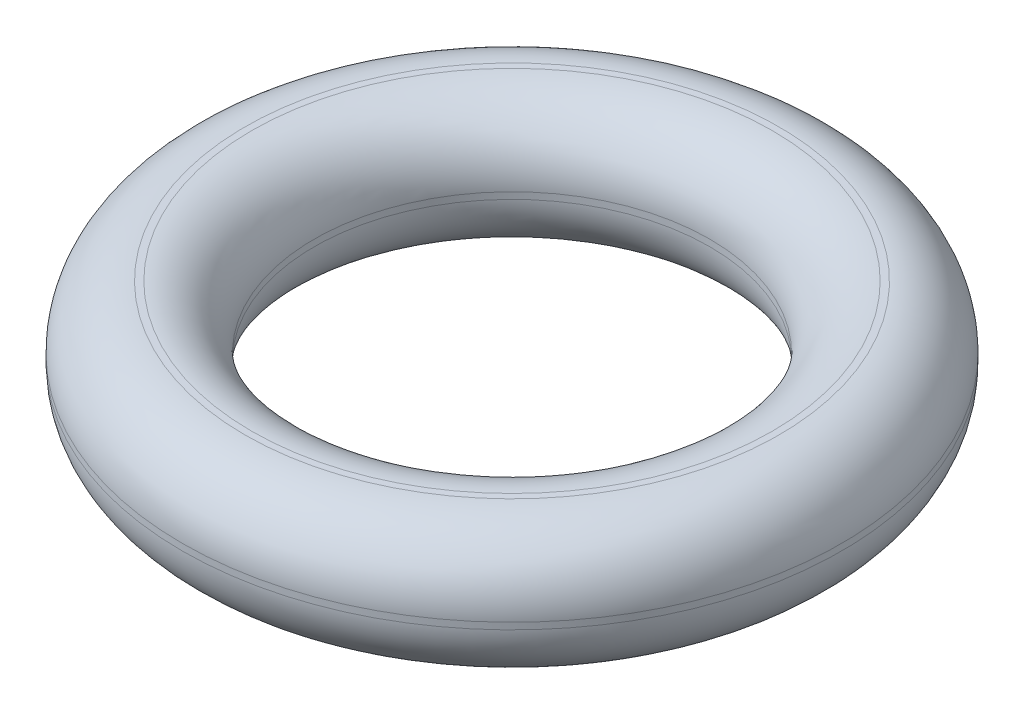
from build123d import *

# Parameters (mm, degrees)
SKETCH1_R           = 2.5
SKETCH1_R_2         = 1.5
BOSS_EXTRUDE1_DEPTH = 1
FILLET1_R           = 0.475


with BuildPart() as part:
    # Sketch1 → Boss-Extrude1 (new body)
    with BuildSketch(Plane(origin=(0, 0, 0), x_dir=(1, 0, 0), z_dir=(0, 1, 0))):
        with Locations(Location((0, 0, 0), (0, 0, 270))):
            Circle(SKETCH1_R)
        with Locations(Location((0, 0, 0), (0, 0, 270))):
            Circle(SKETCH1_R_2, mode=Mode.SUBTRACT)
    extrude(amount=BOSS_EXTRUDE1_DEPTH)

    # Fillet1
    fillet1_edges = [part.edges().sort_by_distance(p)[0] for p in [
        (0, 0, -2.5),
        (0, 1, -2.5),
        (0, 0, -1.5),
        (0, 1, -1.5),
    ]]
    fillet(fillet1_edges, radius=FILLET1_R)


solid = part.part
